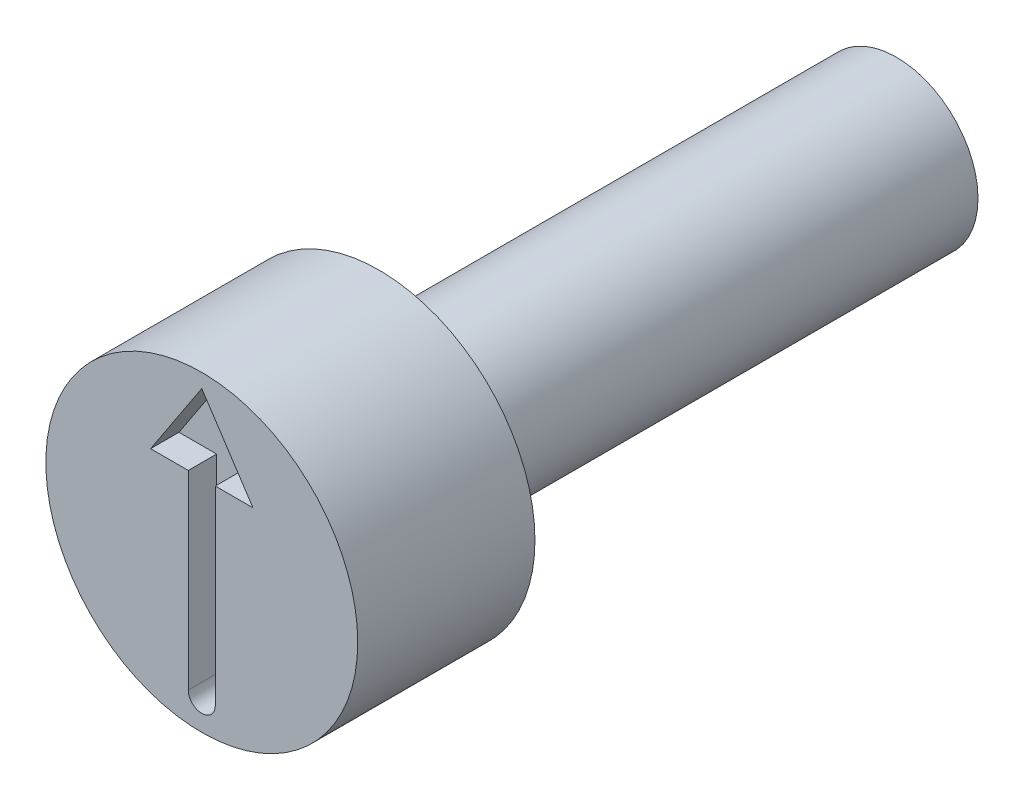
ISO-10303-21;
HEADER;
FILE_DESCRIPTION(('STEP AP214'),'2;1');
FILE_NAME('part.step','',(''),(''),'','','');
FILE_SCHEMA(('AUTOMOTIVE_DESIGN { 1 0 10303 214 1 1 1 1 }'));
ENDSEC;
DATA;
#1=APPLICATION_CONTEXT('core data for automotive mechanical design processes');
#2=APPLICATION_PROTOCOL_DEFINITION('international standard','automotive_design',2000,#1);
#3=PRODUCT_CONTEXT('',#1,'mechanical');
#4=PRODUCT('Part','Part','',(#3));
#5=PRODUCT_RELATED_PRODUCT_CATEGORY('part','',(#4));
#6=PRODUCT_DEFINITION_FORMATION('','',#4);
#7=PRODUCT_DEFINITION_CONTEXT('part definition',#1,'design');
#8=PRODUCT_DEFINITION('design','',#6,#7);
#9=PRODUCT_DEFINITION_SHAPE('','',#8);
#10=(LENGTH_UNIT() NAMED_UNIT(*) SI_UNIT(.MILLI.,.METRE.));
#11=(NAMED_UNIT(*) PLANE_ANGLE_UNIT() SI_UNIT($,.RADIAN.));
#12=(NAMED_UNIT(*) SI_UNIT($,.STERADIAN.) SOLID_ANGLE_UNIT());
#13=UNCERTAINTY_MEASURE_WITH_UNIT(LENGTH_MEASURE(1.E-05),#10,'distance_accuracy_value','');
#14=(GEOMETRIC_REPRESENTATION_CONTEXT(3) GLOBAL_UNCERTAINTY_ASSIGNED_CONTEXT((#13)) GLOBAL_UNIT_ASSIGNED_CONTEXT((#10,
#11,#12)) REPRESENTATION_CONTEXT('',''));
#15=CARTESIAN_POINT('',(0.,0.,0.));
#16=DIRECTION('',(0.,0.,1.));
#17=DIRECTION('',(1.,0.,0.));
#18=AXIS2_PLACEMENT_3D('',#15,#16,#17);
#19=CARTESIAN_POINT('',(0.,1.15,-2.5));
#20=DIRECTION('',(0.,0.,1.));
#21=DIRECTION('',(1.,0.,0.));
#22=AXIS2_PLACEMENT_3D('',#19,#20,#21);
#23=PLANE('',#22);
#24=CARTESIAN_POINT('',(0.,0.,-2.5));
#25=DIRECTION('',(0.,0.,1.));
#26=DIRECTION('',(1.,0.,0.));
#27=AXIS2_PLACEMENT_3D('',#24,#25,#26);
#28=CIRCLE('',#27,2.2);
#29=CARTESIAN_POINT('',(2.2,0.,-2.5));
#30=VERTEX_POINT('',#29);
#31=EDGE_CURVE('E11',#30,#30,#28,.T.);
#32=ORIENTED_EDGE('',*,*,#31,.F.);
#33=EDGE_LOOP('',(#32));
#34=FACE_BOUND('',#33,.T.);
#35=CARTESIAN_POINT('',(0.,0.,-2.5));
#36=DIRECTION('',(0.,0.,1.));
#37=DIRECTION('',(1.,0.,0.));
#38=AXIS2_PLACEMENT_3D('',#35,#36,#37);
#39=CIRCLE('',#38,1.15);
#40=CARTESIAN_POINT('',(1.15,0.,-2.5));
#41=VERTEX_POINT('',#40);
#42=EDGE_CURVE('E144',#41,#41,#39,.T.);
#43=ORIENTED_EDGE('',*,*,#42,.T.);
#44=EDGE_LOOP('',(#43));
#45=FACE_BOUND('',#44,.T.);
#46=ADVANCED_FACE('F34',(#34,#45),#23,.F.);
#47=CARTESIAN_POINT('',(0.,0.,-0.403888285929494));
#48=DIRECTION('',(0.,0.,1.));
#49=DIRECTION('',(1.,0.,0.));
#50=AXIS2_PLACEMENT_3D('',#47,#48,#49);
#51=CYLINDRICAL_SURFACE('',#50,2.2);
#52=CARTESIAN_POINT('',(0.,0.,0.));
#53=DIRECTION('',(0.,0.,1.));
#54=DIRECTION('',(1.,0.,0.));
#55=AXIS2_PLACEMENT_3D('',#52,#53,#54);
#56=CIRCLE('',#55,2.2);
#57=CARTESIAN_POINT('',(2.2,0.,0.));
#58=VERTEX_POINT('',#57);
#59=EDGE_CURVE('E41',#58,#58,#56,.T.);
#60=ORIENTED_EDGE('',*,*,#59,.F.);
#61=EDGE_LOOP('',(#60));
#62=FACE_BOUND('',#61,.T.);
#63=ORIENTED_EDGE('',*,*,#31,.T.);
#64=EDGE_LOOP('',(#63));
#65=FACE_BOUND('',#64,.T.);
#66=ADVANCED_FACE('F161',(#62,#65),#51,.T.);
#67=CARTESIAN_POINT('',(0.,2.2,0.));
#68=DIRECTION('',(0.,0.,-1.));
#69=DIRECTION('',(-1.,0.,0.));
#70=AXIS2_PLACEMENT_3D('',#67,#68,#69);
#71=PLANE('',#70);
#72=DIRECTION('',(0.,1.,0.));
#73=VECTOR('',#72,1.);
#74=CARTESIAN_POINT('',(0.190473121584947,0.906351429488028,0.));
#75=LINE('',#74,#73);
#76=CARTESIAN_POINT('',(0.190473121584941,-1.77616183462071,0.));
#77=VERTEX_POINT('',#76);
#78=CARTESIAN_POINT('',(0.190473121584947,0.906351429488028,0.));
#79=VERTEX_POINT('',#78);
#80=EDGE_CURVE('E128',#77,#79,#75,.T.);
#81=ORIENTED_EDGE('',*,*,#80,.F.);
#82=CARTESIAN_POINT('',(1.6342449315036E-13,-1.77616183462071,0.));
#83=DIRECTION('',(0.,0.,1.));
#84=DIRECTION('',(1.,0.,0.));
#85=AXIS2_PLACEMENT_3D('',#82,#83,#84);
#86=CIRCLE('',#85,0.190473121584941);
#87=CARTESIAN_POINT('',(-0.190473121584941,-1.77616183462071,0.));
#88=VERTEX_POINT('',#87);
#89=EDGE_CURVE('E48',#88,#77,#86,.T.);
#90=ORIENTED_EDGE('',*,*,#89,.F.);
#91=DIRECTION('',(0.,-1.,0.));
#92=VECTOR('',#91,1.);
#93=CARTESIAN_POINT('',(-0.190473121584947,0.906351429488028,0.));
#94=LINE('',#93,#92);
#95=CARTESIAN_POINT('',(-0.190473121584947,0.906351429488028,0.));
#96=VERTEX_POINT('',#95);
#97=EDGE_CURVE('E140',#96,#88,#94,.T.);
#98=ORIENTED_EDGE('',*,*,#97,.F.);
#99=DIRECTION('',(1.,0.,0.));
#100=VECTOR('',#99,1.);
#101=CARTESIAN_POINT('',(-0.721917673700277,0.906351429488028,0.));
#102=LINE('',#101,#100);
#103=CARTESIAN_POINT('',(-0.721917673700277,0.906351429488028,0.));
#104=VERTEX_POINT('',#103);
#105=EDGE_CURVE('E138',#104,#96,#102,.T.);
#106=ORIENTED_EDGE('',*,*,#105,.F.);
#107=DIRECTION('',(-0.550159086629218,-0.835059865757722,0.));
#108=VECTOR('',#107,1.);
#109=CARTESIAN_POINT('',(0.,2.00211534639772,0.));
#110=LINE('',#109,#108);
#111=CARTESIAN_POINT('',(0.,2.00211534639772,0.));
#112=VERTEX_POINT('',#111);
#113=EDGE_CURVE('E102',#112,#104,#110,.T.);
#114=ORIENTED_EDGE('',*,*,#113,.F.);
#115=DIRECTION('',(-0.550159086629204,0.835059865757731,0.));
#116=VECTOR('',#115,1.);
#117=CARTESIAN_POINT('',(0.,2.00211534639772,0.));
#118=LINE('',#117,#116);
#119=CARTESIAN_POINT('',(0.721917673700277,0.906351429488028,0.));
#120=VERTEX_POINT('',#119);
#121=EDGE_CURVE('E134',#120,#112,#118,.T.);
#122=ORIENTED_EDGE('',*,*,#121,.F.);
#123=DIRECTION('',(1.,0.,0.));
#124=VECTOR('',#123,1.);
#125=CARTESIAN_POINT('',(0.721917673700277,0.906351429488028,0.));
#126=LINE('',#125,#124);
#127=EDGE_CURVE('E131',#79,#120,#126,.T.);
#128=ORIENTED_EDGE('',*,*,#127,.F.);
#129=EDGE_LOOP('',(#81,#90,#98,#106,#114,#122,#128));
#130=FACE_BOUND('',#129,.T.);
#131=ORIENTED_EDGE('',*,*,#59,.T.);
#132=EDGE_LOOP('',(#131));
#133=FACE_BOUND('',#132,.T.);
#134=ADVANCED_FACE('F159',(#130,#133),#71,.F.);
#135=CARTESIAN_POINT('',(0.,0.,-9.8));
#136=DIRECTION('',(0.,0.,1.));
#137=DIRECTION('',(1.,0.,0.));
#138=AXIS2_PLACEMENT_3D('',#135,#136,#137);
#139=PLANE('',#138);
#140=CARTESIAN_POINT('',(0.,0.,-9.8));
#141=DIRECTION('',(0.,0.,1.));
#142=DIRECTION('',(1.,0.,0.));
#143=AXIS2_PLACEMENT_3D('',#140,#141,#142);
#144=CIRCLE('',#143,1.15);
#145=CARTESIAN_POINT('',(1.15,0.,-9.8));
#146=VERTEX_POINT('',#145);
#147=EDGE_CURVE('E154',#146,#146,#144,.T.);
#148=ORIENTED_EDGE('',*,*,#147,.F.);
#149=EDGE_LOOP('',(#148));
#150=FACE_BOUND('',#149,.T.);
#151=ADVANCED_FACE('F174',(#150),#139,.F.);
#152=CARTESIAN_POINT('',(0.,0.,-0.403888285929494));
#153=DIRECTION('',(0.,0.,1.));
#154=DIRECTION('',(1.,0.,0.));
#155=AXIS2_PLACEMENT_3D('',#152,#153,#154);
#156=CYLINDRICAL_SURFACE('',#155,1.15);
#157=ORIENTED_EDGE('',*,*,#42,.F.);
#158=EDGE_LOOP('',(#157));
#159=FACE_BOUND('',#158,.T.);
#160=ORIENTED_EDGE('',*,*,#147,.T.);
#161=EDGE_LOOP('',(#160));
#162=FACE_BOUND('',#161,.T.);
#163=ADVANCED_FACE('F170',(#159,#162),#156,.T.);
#164=CARTESIAN_POINT('',(1.6342449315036E-13,-1.77616183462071,-0.4));
#165=DIRECTION('',(0.,0.,1.));
#166=DIRECTION('',(1.,0.,0.));
#167=AXIS2_PLACEMENT_3D('',#164,#165,#166);
#168=CYLINDRICAL_SURFACE('',#167,0.190473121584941);
#169=ORIENTED_EDGE('',*,*,#89,.T.);
#170=DIRECTION('',(0.,0.,1.));
#171=VECTOR('',#170,1.);
#172=CARTESIAN_POINT('',(0.190473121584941,-1.77616183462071,-0.4));
#173=LINE('',#172,#171);
#174=CARTESIAN_POINT('',(0.190473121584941,-1.77616183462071,-0.4));
#175=VERTEX_POINT('',#174);
#176=EDGE_CURVE('E81',#175,#77,#173,.T.);
#177=ORIENTED_EDGE('',*,*,#176,.F.);
#178=CARTESIAN_POINT('',(1.6342449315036E-13,-1.77616183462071,-0.4));
#179=DIRECTION('',(0.,0.,1.));
#180=DIRECTION('',(1.,0.,0.));
#181=AXIS2_PLACEMENT_3D('',#178,#179,#180);
#182=CIRCLE('',#181,0.190473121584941);
#183=CARTESIAN_POINT('',(-0.190473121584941,-1.77616183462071,-0.4));
#184=VERTEX_POINT('',#183);
#185=EDGE_CURVE('E142',#184,#175,#182,.T.);
#186=ORIENTED_EDGE('',*,*,#185,.F.);
#187=DIRECTION('',(0.,0.,1.));
#188=VECTOR('',#187,1.);
#189=CARTESIAN_POINT('',(-0.190473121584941,-1.77616183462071,-0.4));
#190=LINE('',#189,#188);
#191=EDGE_CURVE('E56',#184,#88,#190,.T.);
#192=ORIENTED_EDGE('',*,*,#191,.T.);
#193=EDGE_LOOP('',(#169,#177,#186,#192));
#194=FACE_BOUND('',#193,.T.);
#195=ADVANCED_FACE('F173',(#194),#168,.F.);
#196=CARTESIAN_POINT('',(-0.190473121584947,0.906351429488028,-0.4));
#197=DIRECTION('',(-1.,0.,0.));
#198=DIRECTION('',(0.,-1.,0.));
#199=AXIS2_PLACEMENT_3D('',#196,#197,#198);
#200=PLANE('',#199);
#201=ORIENTED_EDGE('',*,*,#97,.T.);
#202=ORIENTED_EDGE('',*,*,#191,.F.);
#203=DIRECTION('',(0.,-1.,0.));
#204=VECTOR('',#203,1.);
#205=CARTESIAN_POINT('',(-0.190473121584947,0.906351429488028,-0.4));
#206=LINE('',#205,#204);
#207=CARTESIAN_POINT('',(-0.190473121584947,0.906351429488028,-0.4));
#208=VERTEX_POINT('',#207);
#209=EDGE_CURVE('E114',#208,#184,#206,.T.);
#210=ORIENTED_EDGE('',*,*,#209,.F.);
#211=DIRECTION('',(0.,0.,1.));
#212=VECTOR('',#211,1.);
#213=CARTESIAN_POINT('',(-0.190473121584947,0.906351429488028,-0.4));
#214=LINE('',#213,#212);
#215=EDGE_CURVE('E106',#208,#96,#214,.T.);
#216=ORIENTED_EDGE('',*,*,#215,.T.);
#217=EDGE_LOOP('',(#201,#202,#210,#216));
#218=FACE_BOUND('',#217,.T.);
#219=ADVANCED_FACE('F188',(#218),#200,.F.);
#220=CARTESIAN_POINT('',(-0.721917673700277,0.906351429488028,-0.4));
#221=DIRECTION('',(0.,-1.,0.));
#222=DIRECTION('',(0.,0.,-1.));
#223=AXIS2_PLACEMENT_3D('',#220,#221,#222);
#224=PLANE('',#223);
#225=ORIENTED_EDGE('',*,*,#105,.T.);
#226=ORIENTED_EDGE('',*,*,#215,.F.);
#227=DIRECTION('',(1.,0.,0.));
#228=VECTOR('',#227,1.);
#229=CARTESIAN_POINT('',(-0.721917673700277,0.906351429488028,-0.4));
#230=LINE('',#229,#228);
#231=CARTESIAN_POINT('',(-0.721917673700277,0.906351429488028,-0.4));
#232=VERTEX_POINT('',#231);
#233=EDGE_CURVE('E110',#232,#208,#230,.T.);
#234=ORIENTED_EDGE('',*,*,#233,.F.);
#235=DIRECTION('',(0.,0.,1.));
#236=VECTOR('',#235,1.);
#237=CARTESIAN_POINT('',(-0.721917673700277,0.906351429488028,-0.4));
#238=LINE('',#237,#236);
#239=EDGE_CURVE('E95',#232,#104,#238,.T.);
#240=ORIENTED_EDGE('',*,*,#239,.T.);
#241=EDGE_LOOP('',(#225,#226,#234,#240));
#242=FACE_BOUND('',#241,.T.);
#243=ADVANCED_FACE('F111',(#242),#224,.F.);
#244=CARTESIAN_POINT('',(0.,2.00211534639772,-0.4));
#245=DIRECTION('',(-0.835059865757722,0.550159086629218,0.));
#246=DIRECTION('',(-0.550159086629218,-0.835059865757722,0.));
#247=AXIS2_PLACEMENT_3D('',#244,#245,#246);
#248=PLANE('',#247);
#249=ORIENTED_EDGE('',*,*,#113,.T.);
#250=ORIENTED_EDGE('',*,*,#239,.F.);
#251=DIRECTION('',(-0.550159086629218,-0.835059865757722,0.));
#252=VECTOR('',#251,1.);
#253=CARTESIAN_POINT('',(0.,2.00211534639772,-0.4));
#254=LINE('',#253,#252);
#255=CARTESIAN_POINT('',(0.,2.00211534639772,-0.4));
#256=VERTEX_POINT('',#255);
#257=EDGE_CURVE('E99',#256,#232,#254,.T.);
#258=ORIENTED_EDGE('',*,*,#257,.F.);
#259=DIRECTION('',(0.,0.,1.));
#260=VECTOR('',#259,1.);
#261=CARTESIAN_POINT('',(0.,2.00211534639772,-0.4));
#262=LINE('',#261,#260);
#263=EDGE_CURVE('E107',#256,#112,#262,.T.);
#264=ORIENTED_EDGE('',*,*,#263,.T.);
#265=EDGE_LOOP('',(#249,#250,#258,#264));
#266=FACE_BOUND('',#265,.T.);
#267=ADVANCED_FACE('F97',(#266),#248,.F.);
#268=CARTESIAN_POINT('',(0.,2.00211534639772,-0.4));
#269=DIRECTION('',(0.835059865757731,0.550159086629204,0.));
#270=DIRECTION('',(-0.550159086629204,0.835059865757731,0.));
#271=AXIS2_PLACEMENT_3D('',#268,#269,#270);
#272=PLANE('',#271);
#273=ORIENTED_EDGE('',*,*,#121,.T.);
#274=ORIENTED_EDGE('',*,*,#263,.F.);
#275=DIRECTION('',(-0.550159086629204,0.835059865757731,0.));
#276=VECTOR('',#275,1.);
#277=CARTESIAN_POINT('',(0.,2.00211534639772,-0.4));
#278=LINE('',#277,#276);
#279=CARTESIAN_POINT('',(0.721917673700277,0.906351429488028,-0.4));
#280=VERTEX_POINT('',#279);
#281=EDGE_CURVE('E120',#280,#256,#278,.T.);
#282=ORIENTED_EDGE('',*,*,#281,.F.);
#283=DIRECTION('',(0.,0.,1.));
#284=VECTOR('',#283,1.);
#285=CARTESIAN_POINT('',(0.721917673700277,0.906351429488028,-0.4));
#286=LINE('',#285,#284);
#287=EDGE_CURVE('E147',#280,#120,#286,.T.);
#288=ORIENTED_EDGE('',*,*,#287,.T.);
#289=EDGE_LOOP('',(#273,#274,#282,#288));
#290=FACE_BOUND('',#289,.T.);
#291=ADVANCED_FACE('F196',(#290),#272,.F.);
#292=CARTESIAN_POINT('',(0.721917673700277,0.906351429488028,-0.4));
#293=DIRECTION('',(0.,-1.,0.));
#294=DIRECTION('',(0.,0.,-1.));
#295=AXIS2_PLACEMENT_3D('',#292,#293,#294);
#296=PLANE('',#295);
#297=ORIENTED_EDGE('',*,*,#127,.T.);
#298=ORIENTED_EDGE('',*,*,#287,.F.);
#299=DIRECTION('',(1.,0.,0.));
#300=VECTOR('',#299,1.);
#301=CARTESIAN_POINT('',(0.721917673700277,0.906351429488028,-0.4));
#302=LINE('',#301,#300);
#303=CARTESIAN_POINT('',(0.190473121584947,0.906351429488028,-0.4));
#304=VERTEX_POINT('',#303);
#305=EDGE_CURVE('E122',#304,#280,#302,.T.);
#306=ORIENTED_EDGE('',*,*,#305,.F.);
#307=DIRECTION('',(0.,0.,1.));
#308=VECTOR('',#307,1.);
#309=CARTESIAN_POINT('',(0.190473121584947,0.906351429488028,-0.4));
#310=LINE('',#309,#308);
#311=EDGE_CURVE('E149',#304,#79,#310,.T.);
#312=ORIENTED_EDGE('',*,*,#311,.T.);
#313=EDGE_LOOP('',(#297,#298,#306,#312));
#314=FACE_BOUND('',#313,.T.);
#315=ADVANCED_FACE('F192',(#314),#296,.F.);
#316=CARTESIAN_POINT('',(0.190473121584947,0.906351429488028,-0.4));
#317=DIRECTION('',(1.,0.,0.));
#318=DIRECTION('',(0.,1.,0.));
#319=AXIS2_PLACEMENT_3D('',#316,#317,#318);
#320=PLANE('',#319);
#321=ORIENTED_EDGE('',*,*,#80,.T.);
#322=ORIENTED_EDGE('',*,*,#311,.F.);
#323=DIRECTION('',(0.,1.,0.));
#324=VECTOR('',#323,1.);
#325=CARTESIAN_POINT('',(0.190473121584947,0.906351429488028,-0.4));
#326=LINE('',#325,#324);
#327=EDGE_CURVE('E290',#175,#304,#326,.T.);
#328=ORIENTED_EDGE('',*,*,#327,.F.);
#329=ORIENTED_EDGE('',*,*,#176,.T.);
#330=EDGE_LOOP('',(#321,#322,#328,#329));
#331=FACE_BOUND('',#330,.T.);
#332=ADVANCED_FACE('F189',(#331),#320,.F.);
#333=CARTESIAN_POINT('',(1.6342449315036E-13,-1.77616183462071,-0.4));
#334=DIRECTION('',(0.,0.,1.));
#335=DIRECTION('',(1.,0.,0.));
#336=AXIS2_PLACEMENT_3D('',#333,#334,#335);
#337=PLANE('',#336);
#338=ORIENTED_EDGE('',*,*,#185,.T.);
#339=ORIENTED_EDGE('',*,*,#327,.T.);
#340=ORIENTED_EDGE('',*,*,#305,.T.);
#341=ORIENTED_EDGE('',*,*,#281,.T.);
#342=ORIENTED_EDGE('',*,*,#257,.T.);
#343=ORIENTED_EDGE('',*,*,#233,.T.);
#344=ORIENTED_EDGE('',*,*,#209,.T.);
#345=EDGE_LOOP('',(#338,#339,#340,#341,#342,#343,#344));
#346=FACE_BOUND('',#345,.T.);
#347=ADVANCED_FACE('F117',(#346),#337,.T.);
#348=CLOSED_SHELL('',(#46,#66,#134,#151,#163,#195,#219,#243,#267,#291,#315,#332,#347));
#349=MANIFOLD_SOLID_BREP('B2',#348);
#350=ADVANCED_BREP_SHAPE_REPRESENTATION('',(#18,#349),#14);
#351=SHAPE_DEFINITION_REPRESENTATION(#9,#350);
ENDSEC;
END-ISO-10303-21;
